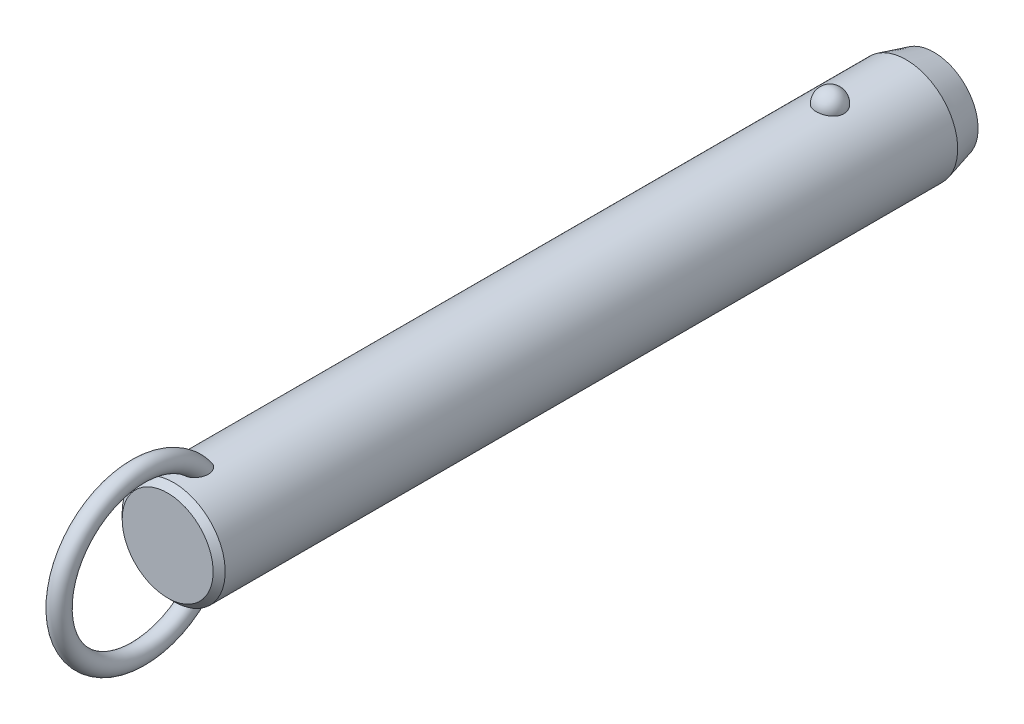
ISO-10303-21;
HEADER;
FILE_DESCRIPTION(('STEP AP214'),'2;1');
FILE_NAME('part.step','',(''),(''),'','','');
FILE_SCHEMA(('AUTOMOTIVE_DESIGN { 1 0 10303 214 1 1 1 1 }'));
ENDSEC;
DATA;
#1=APPLICATION_CONTEXT('core data for automotive mechanical design processes');
#2=APPLICATION_PROTOCOL_DEFINITION('international standard','automotive_design',2000,#1);
#3=PRODUCT_CONTEXT('',#1,'mechanical');
#4=PRODUCT('Part','Part','',(#3));
#5=PRODUCT_RELATED_PRODUCT_CATEGORY('part','',(#4));
#6=PRODUCT_DEFINITION_FORMATION('','',#4);
#7=PRODUCT_DEFINITION_CONTEXT('part definition',#1,'design');
#8=PRODUCT_DEFINITION('design','',#6,#7);
#9=PRODUCT_DEFINITION_SHAPE('','',#8);
#10=(LENGTH_UNIT() NAMED_UNIT(*) SI_UNIT(.MILLI.,.METRE.));
#11=(NAMED_UNIT(*) PLANE_ANGLE_UNIT() SI_UNIT($,.RADIAN.));
#12=(NAMED_UNIT(*) SI_UNIT($,.STERADIAN.) SOLID_ANGLE_UNIT());
#13=UNCERTAINTY_MEASURE_WITH_UNIT(LENGTH_MEASURE(1.E-05),#10,'distance_accuracy_value','');
#14=(GEOMETRIC_REPRESENTATION_CONTEXT(3) GLOBAL_UNCERTAINTY_ASSIGNED_CONTEXT((#13)) GLOBAL_UNIT_ASSIGNED_CONTEXT((#10,
#11,#12)) REPRESENTATION_CONTEXT('',''));
#15=CARTESIAN_POINT('',(0.,0.,0.));
#16=DIRECTION('',(0.,0.,1.));
#17=DIRECTION('',(1.,0.,0.));
#18=AXIS2_PLACEMENT_3D('',#15,#16,#17);
#19=CARTESIAN_POINT('',(0.,0.,127.));
#20=DIRECTION('',(0.,0.,-1.));
#21=DIRECTION('',(-1.,0.,0.));
#22=AXIS2_PLACEMENT_3D('',#19,#20,#21);
#23=CYLINDRICAL_SURFACE('',#22,11.1);
#24=CARTESIAN_POINT('',(2.9724815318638,10.6945945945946,-3.));
#25=CARTESIAN_POINT('',(2.97247830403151,10.6945972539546,-2.83225059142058));
#26=CARTESIAN_POINT('',(2.95876598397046,10.6984356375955,-2.66445972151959));
#27=CARTESIAN_POINT('',(2.90424529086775,10.7133624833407,-2.33362381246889));
#28=CARTESIAN_POINT('',(2.8634252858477,10.7244540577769,-2.1705808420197));
#29=CARTESIAN_POINT('',(2.75573657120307,10.7526272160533,-1.85396767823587));
#30=CARTESIAN_POINT('',(2.68887937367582,10.7697061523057,-1.70039333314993));
#31=CARTESIAN_POINT('',(2.53079696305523,10.8079438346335,-1.40691598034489));
#32=CARTESIAN_POINT('',(2.43957264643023,10.8291024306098,-1.2670124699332));
#33=CARTESIAN_POINT('',(2.23458150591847,10.8732541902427,-1.00409565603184));
#34=CARTESIAN_POINT('',(2.12071295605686,10.8962553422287,-0.881162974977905));
#35=CARTESIAN_POINT('',(1.87365402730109,10.9414421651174,-0.656352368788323));
#36=CARTESIAN_POINT('',(1.74046358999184,10.9636278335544,-0.554474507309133));
#37=CARTESIAN_POINT('',(1.45872188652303,11.0046495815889,-0.374872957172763));
#38=CARTESIAN_POINT('',(1.31021276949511,11.0234944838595,-0.297085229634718));
#39=CARTESIAN_POINT('',(1.00170030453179,11.0557957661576,-0.167529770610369));
#40=CARTESIAN_POINT('',(0.841698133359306,11.0692526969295,-0.115759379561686));
#41=CARTESIAN_POINT('',(0.517607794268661,11.0890932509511,-0.0403925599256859));
#42=CARTESIAN_POINT('',(0.353633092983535,11.0955916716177,-0.0163383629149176));
#43=CARTESIAN_POINT('',(0.0238420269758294,11.1011989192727,0.0044517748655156));
#44=CARTESIAN_POINT('',(-0.141974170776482,11.1003084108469,0.00119017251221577));
#45=CARTESIAN_POINT('',(-0.468405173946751,11.0912990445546,-0.0323233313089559));
#46=CARTESIAN_POINT('',(-0.629059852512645,11.0832767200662,-0.0622147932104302));
#47=CARTESIAN_POINT('',(-0.942937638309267,11.0609962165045,-0.147645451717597));
#48=CARTESIAN_POINT('',(-1.09616062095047,11.0467379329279,-0.203185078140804));
#49=CARTESIAN_POINT('',(-1.39181061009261,11.0134071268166,-0.3387529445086));
#50=CARTESIAN_POINT('',(-1.53417383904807,10.9943086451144,-0.418913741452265));
#51=CARTESIAN_POINT('',(-1.80342160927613,10.9533667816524,-0.60144882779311));
#52=CARTESIAN_POINT('',(-1.9303046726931,10.9315231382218,-0.703825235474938));
#53=CARTESIAN_POINT('',(-2.16747598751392,10.887005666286,-0.930091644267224));
#54=CARTESIAN_POINT('',(-2.27742774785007,10.8643239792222,-1.05433291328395));
#55=CARTESIAN_POINT('',(-2.47517316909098,10.8209886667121,-1.31966633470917));
#56=CARTESIAN_POINT('',(-2.56296538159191,10.8003351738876,-1.46075958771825));
#57=CARTESIAN_POINT('',(-2.71500300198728,10.7631304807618,-1.75753646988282));
#58=CARTESIAN_POINT('',(-2.77898901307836,10.7466250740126,-1.91335887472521));
#59=CARTESIAN_POINT('',(-2.88046189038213,10.7198747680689,-2.2339152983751));
#60=CARTESIAN_POINT('',(-2.91794947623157,10.709629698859,-2.39864907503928));
#61=CARTESIAN_POINT('',(-2.96537819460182,10.6965949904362,-2.73165170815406));
#62=CARTESIAN_POINT('',(-2.97542891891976,10.693775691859,-2.89990378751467));
#63=CARTESIAN_POINT('',(-2.96804271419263,10.6958279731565,-3.235752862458));
#64=CARTESIAN_POINT('',(-2.95060646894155,10.7006993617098,-3.40334987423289));
#65=CARTESIAN_POINT('',(-2.88883358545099,10.71753912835,-3.73233906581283));
#66=CARTESIAN_POINT('',(-2.84462026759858,10.7294749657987,-3.89375610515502));
#67=CARTESIAN_POINT('',(-2.73050447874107,10.7590797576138,-4.20667949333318));
#68=CARTESIAN_POINT('',(-2.66060103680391,10.7767489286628,-4.35818546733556));
#69=CARTESIAN_POINT('',(-2.49642559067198,10.8159599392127,-4.6478542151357));
#70=CARTESIAN_POINT('',(-2.40203047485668,10.8375211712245,-4.78594458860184));
#71=CARTESIAN_POINT('',(-2.19143488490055,10.8820570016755,-5.0441038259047));
#72=CARTESIAN_POINT('',(-2.07523364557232,10.9050316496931,-5.16417205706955));
#73=CARTESIAN_POINT('',(-1.82361254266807,10.9499219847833,-5.38334833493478));
#74=CARTESIAN_POINT('',(-1.68812945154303,10.9718338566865,-5.48238464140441));
#75=CARTESIAN_POINT('',(-1.40191298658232,11.0120611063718,-5.65618873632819));
#76=CARTESIAN_POINT('',(-1.25118062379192,11.0303767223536,-5.73095813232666));
#77=CARTESIAN_POINT('',(-0.940570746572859,11.0611653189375,-5.85334725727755));
#78=CARTESIAN_POINT('',(-0.780821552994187,11.0737044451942,-5.90127578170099));
#79=CARTESIAN_POINT('',(-0.455204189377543,11.0918598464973,-5.96992976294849));
#80=CARTESIAN_POINT('',(-0.289336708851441,11.0974768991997,-5.99065827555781));
#81=CARTESIAN_POINT('',(0.0406846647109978,11.1011307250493,-6.00418773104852));
#82=CARTESIAN_POINT('',(0.204817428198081,11.099299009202,-5.99747318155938));
#83=CARTESIAN_POINT('',(0.5295530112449,11.088551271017,-5.9574031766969));
#84=CARTESIAN_POINT('',(0.69015594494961,11.0796354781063,-5.92404858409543));
#85=CARTESIAN_POINT('',(1.0027760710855,11.0557204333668,-5.83180084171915));
#86=CARTESIAN_POINT('',(1.15482001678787,11.0407414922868,-5.77299291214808));
#87=CARTESIAN_POINT('',(1.44678373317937,11.0062913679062,-5.63147366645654));
#88=CARTESIAN_POINT('',(1.58670279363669,10.9868199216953,-5.54876095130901));
#89=CARTESIAN_POINT('',(1.8527023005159,10.9451315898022,-5.36027644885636));
#90=CARTESIAN_POINT('',(1.97855158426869,10.9228788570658,-5.25418644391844));
#91=CARTESIAN_POINT('',(2.21080872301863,10.8782509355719,-5.02251354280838));
#92=CARTESIAN_POINT('',(2.31721312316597,10.8558757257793,-4.89692718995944));
#93=CARTESIAN_POINT('',(2.5094551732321,10.8130715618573,-4.62745408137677));
#94=CARTESIAN_POINT('',(2.59493284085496,10.7926798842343,-4.48330448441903));
#95=CARTESIAN_POINT('',(2.740862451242,10.7565495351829,-4.18236358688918));
#96=CARTESIAN_POINT('',(2.80132490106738,10.7408089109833,-4.02557762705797));
#97=CARTESIAN_POINT('',(2.88959070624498,10.7173718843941,-3.72475308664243));
#98=CARTESIAN_POINT('',(2.92062102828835,10.7088950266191,-3.58171216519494));
#99=CARTESIAN_POINT('',(2.96206765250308,10.6975052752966,-3.29245795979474));
#100=CARTESIAN_POINT('',(2.97248434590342,10.6945922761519,-3.14624473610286));
#101=CARTESIAN_POINT('',(2.9724815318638,10.6945945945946,-3.));
#102=B_SPLINE_CURVE_WITH_KNOTS('',3,(#24,#25,#26,#27,#28,#29,#30,#31,#32,#33,#34,#35,#36,#37,
#38,#39,#40,#41,#42,#43,#44,#45,#46,#47,#48,#49,#50,#51,#52,#53,#54,#55,#56,#57,#58,#59,#60,#61,
#62,#63,#64,#65,#66,#67,#68,#69,#70,#71,#72,#73,#74,#75,#76,#77,#78,#79,#80,#81,#82,#83,#84,#85,
#86,#87,#88,#89,#90,#91,#92,#93,#94,#95,#96,#97,#98,#99,#100,#101),.UNSPECIFIED.,.T.,.F.,(4,2,2,
2,2,2,2,2,2,2,2,2,2,2,2,2,2,2,2,2,2,2,2,2,2,2,2,2,2,2,2,2,2,2,2,2,2,2,4),(0.,0.502722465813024,
1.00566079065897,1.5083769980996,2.01107471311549,2.51608392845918,3.02109467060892,
3.52475118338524,4.02835620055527,4.523518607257,5.0186364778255,5.50715297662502,
5.9956776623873,6.48688002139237,6.97812923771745,7.47814366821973,7.9781907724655,
8.48353712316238,8.9888697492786,9.49218093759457,9.99547960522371,10.4964777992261,
10.997494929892,11.5010810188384,12.0046847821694,12.5099796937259,13.0152411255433,
13.5145635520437,14.0138298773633,14.5043200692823,14.9947943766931,15.4836390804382,
15.9725123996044,16.4685040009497,16.9645836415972,17.4686765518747,17.972557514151,
18.410841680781,18.849117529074),.UNSPECIFIED.);
#103=CARTESIAN_POINT('',(2.9724815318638,10.6945945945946,-3.));
#104=VERTEX_POINT('',#103);
#105=EDGE_CURVE('E41',#104,#104,#102,.T.);
#106=ORIENTED_EDGE('',*,*,#105,.T.);
#107=EDGE_LOOP('',(#106));
#108=FACE_BOUND('',#107,.T.);
#109=CARTESIAN_POINT('',(0.,0.,138.4));
#110=DIRECTION('',(0.,0.,1.));
#111=DIRECTION('',(1.,0.,0.));
#112=AXIS2_PLACEMENT_3D('',#109,#110,#111);
#113=CIRCLE('',#112,11.1);
#114=CARTESIAN_POINT('',(-11.1,0.,138.4));
#115=VERTEX_POINT('',#114);
#116=EDGE_CURVE('E10',#115,#115,#113,.F.);
#117=ORIENTED_EDGE('',*,*,#116,.T.);
#118=EDGE_LOOP('',(#117));
#119=FACE_BOUND('',#118,.T.);
#120=CARTESIAN_POINT('',(-0.564520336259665,-11.0856356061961,130.657815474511));
#121=CARTESIAN_POINT('',(-0.667202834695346,-11.0804062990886,130.691283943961));
#122=CARTESIAN_POINT('',(-0.766875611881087,-11.0738877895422,130.733835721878));
#123=CARTESIAN_POINT('',(-0.95728412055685,-11.0590576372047,130.835419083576));
#124=CARTESIAN_POINT('',(-1.04801616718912,-11.0507452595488,130.89445742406));
#125=CARTESIAN_POINT('',(-1.21800952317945,-11.0333016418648,131.026529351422));
#126=CARTESIAN_POINT('',(-1.2973080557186,-11.0241732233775,131.099515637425));
#127=CARTESIAN_POINT('',(-1.44337665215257,-11.0060026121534,131.257037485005));
#128=CARTESIAN_POINT('',(-1.51014622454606,-10.9969604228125,131.341573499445));
#129=CARTESIAN_POINT('',(-1.63454620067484,-10.9791841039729,131.525521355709));
#130=CARTESIAN_POINT('',(-1.69127003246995,-10.9705107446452,131.625549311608));
#131=CARTESIAN_POINT('',(-1.7898078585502,-10.9548648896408,131.832790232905));
#132=CARTESIAN_POINT('',(-1.83161214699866,-10.9478935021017,131.940007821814));
#133=CARTESIAN_POINT('',(-1.91557028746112,-10.9335803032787,132.205408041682));
#134=CARTESIAN_POINT('',(-1.95040620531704,-10.9273269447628,132.365980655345));
#135=CARTESIAN_POINT('',(-1.99388326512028,-10.9194709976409,132.690697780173));
#136=CARTESIAN_POINT('',(-2.00248051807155,-10.9178762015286,132.854847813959));
#137=CARTESIAN_POINT('',(-1.99551615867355,-10.9191578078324,133.224650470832));
#138=CARTESIAN_POINT('',(-1.9732206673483,-10.9232807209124,133.430191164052));
#139=CARTESIAN_POINT('',(-1.9152976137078,-10.9335244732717,133.733595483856));
#140=CARTESIAN_POINT('',(-1.89184575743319,-10.9376266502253,133.834088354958));
#141=CARTESIAN_POINT('',(-1.83700674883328,-10.9469720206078,134.032855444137));
#142=CARTESIAN_POINT('',(-1.80562070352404,-10.9522150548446,134.131129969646));
#143=CARTESIAN_POINT('',(-1.73463055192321,-10.9636837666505,134.325914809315));
#144=CARTESIAN_POINT('',(-1.69493416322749,-10.9699202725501,134.422390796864));
#145=CARTESIAN_POINT('',(-1.60745141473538,-10.9830806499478,134.611626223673));
#146=CARTESIAN_POINT('',(-1.55966150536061,-10.9900048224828,134.704384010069));
#147=CARTESIAN_POINT('',(-1.45591812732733,-11.0042280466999,134.884690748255));
#148=CARTESIAN_POINT('',(-1.40000013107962,-11.0115253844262,134.972260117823));
#149=CARTESIAN_POINT('',(-1.27937470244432,-11.0261911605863,135.141029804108));
#150=CARTESIAN_POINT('',(-1.21467835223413,-11.0335594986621,135.22223795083));
#151=CARTESIAN_POINT('',(-1.08218150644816,-11.0473027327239,135.369001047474));
#152=CARTESIAN_POINT('',(-1.01522633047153,-11.0537063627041,135.435309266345));
#153=CARTESIAN_POINT('',(-0.872952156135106,-11.065850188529,135.558378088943));
#154=CARTESIAN_POINT('',(-0.797642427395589,-11.0715911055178,135.615149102));
#155=CARTESIAN_POINT('',(-0.651396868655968,-11.081071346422,135.707515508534));
#156=CARTESIAN_POINT('',(-0.581712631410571,-11.0849841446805,135.745049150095));
#157=CARTESIAN_POINT('',(-0.43706608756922,-11.0916271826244,135.808259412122));
#158=CARTESIAN_POINT('',(-0.362109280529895,-11.0943586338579,135.833948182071));
#159=CARTESIAN_POINT('',(-0.207828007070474,-11.0983242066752,135.871117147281));
#160=CARTESIAN_POINT('',(-0.12846771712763,-11.0995432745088,135.882454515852));
#161=CARTESIAN_POINT('',(0.0309101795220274,-11.1002423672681,135.888965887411));
#162=CARTESIAN_POINT('',(0.110927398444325,-11.0997233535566,135.884148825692));
#163=CARTESIAN_POINT('',(0.25640659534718,-11.097240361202,135.860959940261));
#164=CARTESIAN_POINT('',(0.322235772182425,-11.0955074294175,135.844754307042));
#165=CARTESIAN_POINT('',(0.450635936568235,-11.0910350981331,135.802600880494));
#166=CARTESIAN_POINT('',(0.513205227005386,-11.0882951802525,135.776648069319));
#167=CARTESIAN_POINT('',(0.662626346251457,-11.0805620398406,135.702607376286));
#168=CARTESIAN_POINT('',(0.747127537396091,-11.0751144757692,135.649845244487));
#169=CARTESIAN_POINT('',(0.906756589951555,-11.0631932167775,135.531720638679));
#170=CARTESIAN_POINT('',(0.981859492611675,-11.0567168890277,135.466325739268));
#171=CARTESIAN_POINT('',(1.10712207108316,-11.0447856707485,135.34226337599));
#172=CARTESIAN_POINT('',(1.15909566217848,-11.0394280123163,135.285383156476));
#173=CARTESIAN_POINT('',(1.25791923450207,-11.0286040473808,135.167327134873));
#174=CARTESIAN_POINT('',(1.30476642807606,-11.0231376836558,135.106149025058));
#175=CARTESIAN_POINT('',(1.43818612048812,-11.0068027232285,134.917305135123));
#176=CARTESIAN_POINT('',(1.51751767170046,-10.9960104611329,134.784453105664));
#177=CARTESIAN_POINT('',(1.63597546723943,-10.9788847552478,134.553137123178));
#178=CARTESIAN_POINT('',(1.67988876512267,-10.9722190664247,134.457053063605));
#179=CARTESIAN_POINT('',(1.75953241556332,-10.9597298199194,134.261431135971));
#180=CARTESIAN_POINT('',(1.7952596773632,-10.9539065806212,134.161891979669));
#181=CARTESIAN_POINT('',(1.85844731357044,-10.9433632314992,133.96021118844));
#182=CARTESIAN_POINT('',(1.88591073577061,-10.9386427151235,133.85807052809));
#183=CARTESIAN_POINT('',(1.93234324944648,-10.9305350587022,133.651819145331));
#184=CARTESIAN_POINT('',(1.95131065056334,-10.9271481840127,133.547708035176));
#185=CARTESIAN_POINT('',(1.9904020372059,-10.9201183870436,133.265458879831));
#186=CARTESIAN_POINT('',(2.00221217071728,-10.9179256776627,133.086037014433));
#187=CARTESIAN_POINT('',(1.99711676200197,-10.9188636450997,132.727713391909));
#188=CARTESIAN_POINT('',(1.98026150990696,-10.9219849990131,132.548811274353));
#189=CARTESIAN_POINT('',(1.92151657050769,-10.9324473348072,132.23645144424));
#190=CARTESIAN_POINT('',(1.88605081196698,-10.9386915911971,132.101759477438));
#191=CARTESIAN_POINT('',(1.79393020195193,-10.9541780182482,131.839966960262));
#192=CARTESIAN_POINT('',(1.73729868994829,-10.9634168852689,131.712858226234));
#193=CARTESIAN_POINT('',(1.61237037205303,-10.9824218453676,131.489418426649));
#194=CARTESIAN_POINT('',(1.54715374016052,-10.9918945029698,131.391345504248));
#195=CARTESIAN_POINT('',(1.40127026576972,-11.0114415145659,131.207434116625));
#196=CARTESIAN_POINT('',(1.32060742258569,-11.0215157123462,131.121592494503));
#197=CARTESIAN_POINT('',(1.1447478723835,-11.041168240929,130.965163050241));
#198=CARTESIAN_POINT('',(1.04947805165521,-11.0507437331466,130.894656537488));
#199=CARTESIAN_POINT('',(0.847278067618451,-11.0680789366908,130.772640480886));
#200=CARTESIAN_POINT('',(0.74035174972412,-11.0758392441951,130.721124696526));
#201=CARTESIAN_POINT('',(0.529289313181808,-11.0878275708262,130.643485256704));
#202=CARTESIAN_POINT('',(0.425895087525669,-11.0923259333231,130.615377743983));
#203=CARTESIAN_POINT('',(0.215723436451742,-11.0984001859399,130.577703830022));
#204=CARTESIAN_POINT('',(0.108947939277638,-11.0999777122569,130.568127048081));
#205=CARTESIAN_POINT('',(-0.0938962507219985,-11.1000196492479,130.567877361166));
#206=CARTESIAN_POINT('',(-0.189967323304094,-11.0987797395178,130.575408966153));
#207=CARTESIAN_POINT('',(-0.379657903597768,-11.0939111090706,130.605507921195));
#208=CARTESIAN_POINT('',(-0.47327735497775,-11.0902823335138,130.628075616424));
#209=CARTESIAN_POINT('',(-0.564520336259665,-11.0856356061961,130.657815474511));
#210=B_SPLINE_CURVE_WITH_KNOTS('',3,(#120,#121,#122,#123,#124,#125,#126,#127,#128,#129,#130,
#131,#132,#133,#134,#135,#136,#137,#138,#139,#140,#141,#142,#143,#144,#145,#146,#147,#148,#149,
#150,#151,#152,#153,#154,#155,#156,#157,#158,#159,#160,#161,#162,#163,#164,#165,#166,#167,#168,
#169,#170,#171,#172,#173,#174,#175,#176,#177,#178,#179,#180,#181,#182,#183,#184,#185,#186,#187,
#188,#189,#190,#191,#192,#193,#194,#195,#196,#197,#198,#199,#200,#201,#202,#203,#204,#205,#206,
#207,#208,#209),.UNSPECIFIED.,.T.,.F.,(4,2,2,2,2,2,2,2,2,2,2,2,2,2,2,2,2,2,2,2,2,2,2,2,2,2,2,2,
2,2,2,2,2,2,2,2,2,2,2,2,2,2,2,2,4),(0.,0.323999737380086,0.64813245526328,0.971184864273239,
1.29424994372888,1.63886237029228,1.98369857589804,2.47426059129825,2.96564271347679,
3.58257396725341,3.89215258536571,4.20168803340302,4.51486273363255,4.82817514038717,
5.14015911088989,5.45175282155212,5.73442856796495,6.01679375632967,6.2536458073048,
6.49025437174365,6.72919963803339,6.96801276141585,7.17061258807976,7.37331685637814,
7.67094989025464,7.96935728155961,8.20075067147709,8.4322692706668,8.89581623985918,
9.21306533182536,9.53043400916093,9.84768549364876,10.1650000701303,10.7022930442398,
11.2386443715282,11.655339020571,12.071575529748,12.4245637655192,12.7774607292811,
13.1321855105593,13.4867936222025,13.8068771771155,14.1267813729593,14.4146787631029,
14.7025827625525),.UNSPECIFIED.);
#211=CARTESIAN_POINT('',(-0.564520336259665,-11.0856356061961,130.657815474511));
#212=VERTEX_POINT('',#211);
#213=EDGE_CURVE('E60',#212,#212,#210,.T.);
#214=ORIENTED_EDGE('',*,*,#213,.T.);
#215=EDGE_LOOP('',(#214));
#216=FACE_BOUND('',#215,.T.);
#217=CARTESIAN_POINT('',(-0.564520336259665,11.0856356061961,130.657815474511));
#218=CARTESIAN_POINT('',(-0.468542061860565,11.0905203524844,130.626545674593));
#219=CARTESIAN_POINT('',(-0.369793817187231,11.0942886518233,130.603157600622));
#220=CARTESIAN_POINT('',(-0.169555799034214,11.0991586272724,130.573085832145));
#221=CARTESIAN_POINT('',(-0.0680604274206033,11.1002543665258,130.56643932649));
#222=CARTESIAN_POINT('',(0.134549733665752,11.099646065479,130.570157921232));
#223=CARTESIAN_POINT('',(0.235664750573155,11.0979441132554,130.58051033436));
#224=CARTESIAN_POINT('',(0.434632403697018,11.0919342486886,130.617831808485));
#225=CARTESIAN_POINT('',(0.532486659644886,11.0876276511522,130.644792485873));
#226=CARTESIAN_POINT('',(0.722445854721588,11.0768742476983,130.7144096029));
#227=CARTESIAN_POINT('',(0.814543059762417,11.0704246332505,130.757086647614));
#228=CARTESIAN_POINT('',(0.990565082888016,11.0560659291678,130.856648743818));
#229=CARTESIAN_POINT('',(1.07448844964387,11.048156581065,130.913536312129));
#230=CARTESIAN_POINT('',(1.23562672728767,11.0313221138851,131.042210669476));
#231=CARTESIAN_POINT('',(1.3124268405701,11.0223686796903,131.114511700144));
#232=CARTESIAN_POINT('',(1.45398030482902,11.0045918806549,131.270042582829));
#233=CARTESIAN_POINT('',(1.51873073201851,10.9957685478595,131.353275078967));
#234=CARTESIAN_POINT('',(1.64107232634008,10.9782087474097,131.536384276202));
#235=CARTESIAN_POINT('',(1.6974317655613,10.9695572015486,131.637089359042));
#236=CARTESIAN_POINT('',(1.79515063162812,10.9539887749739,131.845626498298));
#237=CARTESIAN_POINT('',(1.83649966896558,10.9470730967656,131.95346343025));
#238=CARTESIAN_POINT('',(1.91931148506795,10.9329211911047,132.220399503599));
#239=CARTESIAN_POINT('',(1.95340104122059,10.9267904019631,132.381861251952));
#240=CARTESIAN_POINT('',(1.99526195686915,10.9192174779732,132.70821631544));
#241=CARTESIAN_POINT('',(2.00298989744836,10.9177830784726,132.87311484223));
#242=CARTESIAN_POINT('',(1.99396251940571,10.9194420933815,133.244100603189));
#243=CARTESIAN_POINT('',(1.97050829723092,10.923774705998,133.45003871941));
#244=CARTESIAN_POINT('',(1.91079643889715,10.9343131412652,133.753901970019));
#245=CARTESIAN_POINT('',(1.88673702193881,10.9385106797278,133.854529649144));
#246=CARTESIAN_POINT('',(1.8306550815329,10.9480376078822,134.053510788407));
#247=CARTESIAN_POINT('',(1.79863369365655,10.9533668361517,134.151864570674));
#248=CARTESIAN_POINT('',(1.72633365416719,10.9649954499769,134.346720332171));
#249=CARTESIAN_POINT('',(1.68596409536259,10.9713053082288,134.44318790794));
#250=CARTESIAN_POINT('',(1.59707998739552,10.9845964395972,134.632323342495));
#251=CARTESIAN_POINT('',(1.54856169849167,10.9915780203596,134.724989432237));
#252=CARTESIAN_POINT('',(1.44330168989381,11.0058935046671,134.904975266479));
#253=CARTESIAN_POINT('',(1.3865974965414,11.0132257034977,134.992316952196));
#254=CARTESIAN_POINT('',(1.26431158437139,11.0279330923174,135.160456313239));
#255=CARTESIAN_POINT('',(1.19874160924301,11.0353082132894,135.241262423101));
#256=CARTESIAN_POINT('',(1.06542088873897,11.048931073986,135.385985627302));
#257=CARTESIAN_POINT('',(0.998640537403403,11.0552153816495,135.450784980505));
#258=CARTESIAN_POINT('',(0.856896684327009,11.0671032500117,135.570846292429));
#259=CARTESIAN_POINT('',(0.781942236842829,11.0727075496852,135.626118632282));
#260=CARTESIAN_POINT('',(0.636276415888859,11.081949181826,135.715972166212));
#261=CARTESIAN_POINT('',(0.566755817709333,11.0857572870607,135.752441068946));
#262=CARTESIAN_POINT('',(0.422602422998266,11.0921860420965,135.813533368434));
#263=CARTESIAN_POINT('',(0.347974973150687,11.0948079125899,135.838168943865));
#264=CARTESIAN_POINT('',(0.194593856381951,11.0985608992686,135.873323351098));
#265=CARTESIAN_POINT('',(0.115807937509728,11.0996777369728,135.883706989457));
#266=CARTESIAN_POINT('',(-0.0422499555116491,11.1002003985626,135.888574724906));
#267=CARTESIAN_POINT('',(-0.121521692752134,11.09960699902,135.883066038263));
#268=CARTESIAN_POINT('',(-0.266046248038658,11.0970123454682,135.858827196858));
#269=CARTESIAN_POINT('',(-0.331661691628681,11.0952283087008,135.842135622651));
#270=CARTESIAN_POINT('',(-0.459588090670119,11.0906663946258,135.799111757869));
#271=CARTESIAN_POINT('',(-0.52189737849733,11.0878880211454,135.772774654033));
#272=CARTESIAN_POINT('',(-0.671446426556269,11.0800342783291,135.697513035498));
#273=CARTESIAN_POINT('',(-0.756250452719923,11.0744969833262,135.643818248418));
#274=CARTESIAN_POINT('',(-0.916349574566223,11.0624045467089,135.523802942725));
#275=CARTESIAN_POINT('',(-0.991618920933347,11.0558467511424,135.457449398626));
#276=CARTESIAN_POINT('',(-1.11713140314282,11.0437783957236,135.331633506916));
#277=CARTESIAN_POINT('',(-1.1692053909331,11.0383619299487,135.273952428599));
#278=CARTESIAN_POINT('',(-1.26817476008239,11.02743010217,135.154280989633));
#279=CARTESIAN_POINT('',(-1.31506731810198,11.0219146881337,135.092288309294));
#280=CARTESIAN_POINT('',(-1.40399813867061,11.0109399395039,134.964784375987));
#281=CARTESIAN_POINT('',(-1.44602864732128,11.0054807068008,134.899267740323));
#282=CARTESIAN_POINT('',(-1.52538779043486,10.9947621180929,134.765422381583));
#283=CARTESIAN_POINT('',(-1.56271516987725,10.9895028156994,134.697092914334));
#284=CARTESIAN_POINT('',(-1.64537943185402,10.9774790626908,134.533210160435));
#285=CARTESIAN_POINT('',(-1.68879497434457,10.9708503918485,134.4366735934));
#286=CARTESIAN_POINT('',(-1.76740738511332,10.9584602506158,134.240236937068));
#287=CARTESIAN_POINT('',(-1.80260120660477,10.95269910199,134.14033561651));
#288=CARTESIAN_POINT('',(-1.86468657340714,10.9423003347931,133.937966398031));
#289=CARTESIAN_POINT('',(-1.8915816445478,10.9376622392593,133.835499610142));
#290=CARTESIAN_POINT('',(-1.93682458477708,10.9297405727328,133.628642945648));
#291=CARTESIAN_POINT('',(-1.95517082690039,10.9264572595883,133.524252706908));
#292=CARTESIAN_POINT('',(-1.99232562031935,10.9197647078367,133.24262876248));
#293=CARTESIAN_POINT('',(-2.00294603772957,10.9177914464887,133.064185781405));
#294=CARTESIAN_POINT('',(-1.99566675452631,10.9191290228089,132.707996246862));
#295=CARTESIAN_POINT('',(-1.97781651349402,10.9224306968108,132.53024902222));
#296=CARTESIAN_POINT('',(-1.91747214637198,10.9331592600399,132.219792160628));
#297=CARTESIAN_POINT('',(-1.88131022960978,10.9395108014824,132.085825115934));
#298=CARTESIAN_POINT('',(-1.78790380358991,10.9551659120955,131.82559757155));
#299=CARTESIAN_POINT('',(-1.73068309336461,10.9644661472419,131.699328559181));
#300=CARTESIAN_POINT('',(-1.60475573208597,10.9835398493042,131.47741565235));
#301=CARTESIAN_POINT('',(-1.53908879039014,10.9930297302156,131.380026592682));
#302=CARTESIAN_POINT('',(-1.39238608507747,11.0125708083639,131.197525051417));
#303=CARTESIAN_POINT('',(-1.31135150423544,11.0226219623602,131.112411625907));
#304=CARTESIAN_POINT('',(-1.14382035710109,11.0411991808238,130.96529943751));
#305=CARTESIAN_POINT('',(-1.0585850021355,11.0497792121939,130.90186930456));
#306=CARTESIAN_POINT('',(-0.878723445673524,11.0655285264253,130.790250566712));
#307=CARTESIAN_POINT('',(-0.784123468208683,11.0727015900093,130.742020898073));
#308=CARTESIAN_POINT('',(-0.646163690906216,11.0812501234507,130.686023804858));
#309=CARTESIAN_POINT('',(-0.605595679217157,11.0835451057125,130.671197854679));
#310=CARTESIAN_POINT('',(-0.564520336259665,11.0856356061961,130.657815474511));
#311=B_SPLINE_CURVE_WITH_KNOTS('',3,(#217,#218,#219,#220,#221,#222,#223,#224,#225,#226,#227,
#228,#229,#230,#231,#232,#233,#234,#235,#236,#237,#238,#239,#240,#241,#242,#243,#244,#245,#246,
#247,#248,#249,#250,#251,#252,#253,#254,#255,#256,#257,#258,#259,#260,#261,#262,#263,#264,#265,
#266,#267,#268,#269,#270,#271,#272,#273,#274,#275,#276,#277,#278,#279,#280,#281,#282,#283,#284,
#285,#286,#287,#288,#289,#290,#291,#292,#293,#294,#295,#296,#297,#298,#299,#300,#301,#302,#303,
#304,#305,#306,#307,#308,#309,#310),.UNSPECIFIED.,.T.,.F.,(4,2,2,2,2,2,2,2,2,2,2,2,2,2,2,2,2,2,
2,2,2,2,2,2,2,2,2,2,2,2,2,2,2,2,2,2,2,2,2,2,2,2,2,2,2,2,4),(0.,0.303061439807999,
0.606795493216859,0.910302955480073,1.21365733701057,1.51741085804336,1.82121821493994,
2.13745205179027,2.45376252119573,2.79958678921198,3.14564996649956,3.63832391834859,
4.13180893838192,4.75031912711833,5.06071926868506,5.37107516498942,5.6850077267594,
5.99908475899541,6.31176519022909,6.62403542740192,6.90315673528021,7.18197194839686,
7.41687778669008,7.65154134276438,7.88841587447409,8.12518286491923,8.32752842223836,
8.52997509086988,8.82986421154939,9.13054668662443,9.36393502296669,9.5974499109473,
9.83133221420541,10.0652767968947,10.383032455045,10.7009056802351,11.0186436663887,
11.3364420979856,11.8705925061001,12.4038159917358,12.8189662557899,13.2336487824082,
13.5857049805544,13.9377340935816,14.2561354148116,14.5736690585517,14.7033687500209),.UNSPECIFIED.);
#312=CARTESIAN_POINT('',(-0.564520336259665,11.0856356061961,130.657815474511));
#313=VERTEX_POINT('',#312);
#314=EDGE_CURVE('E67',#313,#313,#311,.T.);
#315=ORIENTED_EDGE('',*,*,#314,.T.);
#316=EDGE_LOOP('',(#315));
#317=FACE_BOUND('',#316,.T.);
#318=CARTESIAN_POINT('',(0.,0.,-19.3999999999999));
#319=DIRECTION('',(0.,0.,-1.));
#320=DIRECTION('',(-1.,0.,0.));
#321=AXIS2_PLACEMENT_3D('',#318,#319,#320);
#322=CIRCLE('',#321,11.1);
#323=CARTESIAN_POINT('',(-11.1,0.,-19.3999999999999));
#324=VERTEX_POINT('',#323);
#325=EDGE_CURVE('E57',#324,#324,#322,.F.);
#326=ORIENTED_EDGE('',*,*,#325,.T.);
#327=EDGE_LOOP('',(#326));
#328=FACE_BOUND('',#327,.T.);
#329=ADVANCED_FACE('F37',(#108,#119,#216,#317,#328),#23,.T.);
#330=CARTESIAN_POINT('',(0.,0.,-25.4));
#331=DIRECTION('',(0.,0.,-1.));
#332=DIRECTION('',(-1.,0.,0.));
#333=AXIS2_PLACEMENT_3D('',#330,#331,#332);
#334=PLANE('',#333);
#335=CARTESIAN_POINT('',(0.,0.,-25.4));
#336=DIRECTION('',(0.,0.,-1.));
#337=DIRECTION('',(-1.,0.,0.));
#338=AXIS2_PLACEMENT_3D('',#335,#336,#337);
#339=CIRCLE('',#338,9.49230484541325);
#340=CARTESIAN_POINT('',(-9.49230484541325,0.,-25.4));
#341=VERTEX_POINT('',#340);
#342=EDGE_CURVE('E66',#341,#341,#339,.T.);
#343=ORIENTED_EDGE('',*,*,#342,.T.);
#344=EDGE_LOOP('',(#343));
#345=FACE_BOUND('',#344,.T.);
#346=ADVANCED_FACE('F85',(#345),#334,.T.);
#347=CARTESIAN_POINT('',(0.,0.,-25.4));
#348=DIRECTION('',(0.,0.,1.));
#349=DIRECTION('',(1.,0.,0.));
#350=AXIS2_PLACEMENT_3D('',#347,#348,#349);
#351=CONICAL_SURFACE('',#350,9.49230484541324,0.261799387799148);
#352=ORIENTED_EDGE('',*,*,#325,.F.);
#353=EDGE_LOOP('',(#352));
#354=FACE_BOUND('',#353,.T.);
#355=ORIENTED_EDGE('',*,*,#342,.F.);
#356=EDGE_LOOP('',(#355));
#357=FACE_BOUND('',#356,.T.);
#358=ADVANCED_FACE('F83',(#354,#357),#351,.T.);
#359=CARTESIAN_POINT('',(0.,0.,139.7));
#360=DIRECTION('',(0.,0.,1.));
#361=DIRECTION('',(1.,0.,0.));
#362=AXIS2_PLACEMENT_3D('',#359,#360,#361);
#363=PLANE('',#362);
#364=CARTESIAN_POINT('',(0.,0.,139.7));
#365=DIRECTION('',(0.,0.,1.));
#366=DIRECTION('',(1.,0.,0.));
#367=AXIS2_PLACEMENT_3D('',#364,#365,#366);
#368=CIRCLE('',#367,9.80000000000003);
#369=CARTESIAN_POINT('',(-9.80000000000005,0.,139.7));
#370=VERTEX_POINT('',#369);
#371=EDGE_CURVE('E50',#370,#370,#368,.T.);
#372=ORIENTED_EDGE('',*,*,#371,.T.);
#373=EDGE_LOOP('',(#372));
#374=FACE_BOUND('',#373,.T.);
#375=ADVANCED_FACE('F77',(#374),#363,.T.);
#376=CARTESIAN_POINT('',(0.,0.,146.05));
#377=DIRECTION('',(1.,0.,0.));
#378=DIRECTION('',(0.,0.,-1.));
#379=AXIS2_PLACEMENT_3D('',#376,#377,#378);
#380=TOROIDAL_SURFACE('',#379,17.05,2.);
#381=ORIENTED_EDGE('',*,*,#314,.F.);
#382=EDGE_LOOP('',(#381));
#383=FACE_BOUND('',#382,.T.);
#384=ORIENTED_EDGE('',*,*,#213,.F.);
#385=EDGE_LOOP('',(#384));
#386=FACE_BOUND('',#385,.T.);
#387=ADVANCED_FACE('F73',(#383,#386),#380,.T.);
#388=CARTESIAN_POINT('',(0.,0.,139.7));
#389=DIRECTION('',(0.,0.,-1.));
#390=DIRECTION('',(-1.,0.,0.));
#391=AXIS2_PLACEMENT_3D('',#388,#389,#390);
#392=CONICAL_SURFACE('',#391,9.80000000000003,0.785398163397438);
#393=CARTESIAN_POINT('',(-11.1,0.,138.4));
#394=CARTESIAN_POINT('',(-11.0864583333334,0.,138.413541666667));
#395=CARTESIAN_POINT('',(-11.0729166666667,0.,138.427083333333));
#396=CARTESIAN_POINT('',(-11.0458333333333,0.,138.454166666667));
#397=CARTESIAN_POINT('',(-11.0322916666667,0.,138.467708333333));
#398=CARTESIAN_POINT('',(-11.0052083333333,0.,138.494791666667));
#399=CARTESIAN_POINT('',(-10.9916666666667,0.,138.508333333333));
#400=CARTESIAN_POINT('',(-10.9645833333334,0.,138.535416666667));
#401=CARTESIAN_POINT('',(-10.9510416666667,0.,138.548958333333));
#402=CARTESIAN_POINT('',(-10.9239583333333,0.,138.576041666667));
#403=CARTESIAN_POINT('',(-10.9104166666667,0.,138.589583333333));
#404=CARTESIAN_POINT('',(-10.8833333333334,0.,138.616666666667));
#405=CARTESIAN_POINT('',(-10.8697916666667,0.,138.630208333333));
#406=CARTESIAN_POINT('',(-10.8427083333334,0.,138.657291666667));
#407=CARTESIAN_POINT('',(-10.8291666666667,0.,138.670833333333));
#408=CARTESIAN_POINT('',(-10.8020833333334,0.,138.697916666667));
#409=CARTESIAN_POINT('',(-10.7885416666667,0.,138.711458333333));
#410=CARTESIAN_POINT('',(-10.7614583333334,0.,138.738541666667));
#411=CARTESIAN_POINT('',(-10.7479166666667,0.,138.752083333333));
#412=CARTESIAN_POINT('',(-10.7208333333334,0.,138.779166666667));
#413=CARTESIAN_POINT('',(-10.7072916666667,0.,138.792708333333));
#414=CARTESIAN_POINT('',(-10.6802083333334,0.,138.819791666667));
#415=CARTESIAN_POINT('',(-10.6666666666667,0.,138.833333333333));
#416=CARTESIAN_POINT('',(-10.6395833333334,0.,138.860416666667));
#417=CARTESIAN_POINT('',(-10.6260416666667,0.,138.873958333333));
#418=CARTESIAN_POINT('',(-10.5989583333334,0.,138.901041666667));
#419=CARTESIAN_POINT('',(-10.5854166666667,0.,138.914583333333));
#420=CARTESIAN_POINT('',(-10.5583333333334,0.,138.941666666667));
#421=CARTESIAN_POINT('',(-10.5447916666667,0.,138.955208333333));
#422=CARTESIAN_POINT('',(-10.5177083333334,0.,138.982291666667));
#423=CARTESIAN_POINT('',(-10.5041666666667,0.,138.995833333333));
#424=CARTESIAN_POINT('',(-10.4770833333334,0.,139.022916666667));
#425=CARTESIAN_POINT('',(-10.4635416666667,0.,139.036458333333));
#426=CARTESIAN_POINT('',(-10.4364583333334,0.,139.063541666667));
#427=CARTESIAN_POINT('',(-10.4229166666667,0.,139.077083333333));
#428=CARTESIAN_POINT('',(-10.3958333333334,0.,139.104166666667));
#429=CARTESIAN_POINT('',(-10.3822916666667,0.,139.117708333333));
#430=CARTESIAN_POINT('',(-10.3552083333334,0.,139.144791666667));
#431=CARTESIAN_POINT('',(-10.3416666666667,0.,139.158333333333));
#432=CARTESIAN_POINT('',(-10.3145833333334,0.,139.185416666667));
#433=CARTESIAN_POINT('',(-10.3010416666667,0.,139.198958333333));
#434=CARTESIAN_POINT('',(-10.2739583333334,0.,139.226041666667));
#435=CARTESIAN_POINT('',(-10.2604166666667,0.,139.239583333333));
#436=CARTESIAN_POINT('',(-10.2333333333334,0.,139.266666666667));
#437=CARTESIAN_POINT('',(-10.2197916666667,0.,139.280208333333));
#438=CARTESIAN_POINT('',(-10.1927083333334,0.,139.307291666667));
#439=CARTESIAN_POINT('',(-10.1791666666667,0.,139.320833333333));
#440=CARTESIAN_POINT('',(-10.1520833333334,0.,139.347916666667));
#441=CARTESIAN_POINT('',(-10.1385416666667,0.,139.361458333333));
#442=CARTESIAN_POINT('',(-10.1114583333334,0.,139.388541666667));
#443=CARTESIAN_POINT('',(-10.0979166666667,0.,139.402083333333));
#444=CARTESIAN_POINT('',(-10.0708333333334,0.,139.429166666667));
#445=CARTESIAN_POINT('',(-10.0572916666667,0.,139.442708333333));
#446=CARTESIAN_POINT('',(-10.0302083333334,0.,139.469791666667));
#447=CARTESIAN_POINT('',(-10.0166666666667,0.,139.483333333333));
#448=CARTESIAN_POINT('',(-9.98958333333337,0.,139.510416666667));
#449=CARTESIAN_POINT('',(-9.97604166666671,0.,139.523958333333));
#450=CARTESIAN_POINT('',(-9.94895833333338,0.,139.551041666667));
#451=CARTESIAN_POINT('',(-9.93541666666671,0.,139.564583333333));
#452=CARTESIAN_POINT('',(-9.90833333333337,0.,139.591666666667));
#453=CARTESIAN_POINT('',(-9.89479166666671,0.,139.605208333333));
#454=CARTESIAN_POINT('',(-9.86770833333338,0.,139.632291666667));
#455=CARTESIAN_POINT('',(-9.85416666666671,0.,139.645833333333));
#456=CARTESIAN_POINT('',(-9.82708333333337,0.,139.672916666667));
#457=CARTESIAN_POINT('',(-9.8135416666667,0.,139.686458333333));
#458=CARTESIAN_POINT('',(-9.80000000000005,0.,139.7));
#459=B_SPLINE_CURVE_WITH_KNOTS('',3,(#393,#394,#395,#396,#397,#398,#399,#400,#401,#402,#403,
#404,#405,#406,#407,#408,#409,#410,#411,#412,#413,#414,#415,#416,#417,#418,#419,#420,#421,#422,
#423,#424,#425,#426,#427,#428,#429,#430,#431,#432,#433,#434,#435,#436,#437,#438,#439,#440,#441,
#442,#443,#444,#445,#446,#447,#448,#449,#450,#451,#452,#453,#454,#455,#456,#457,#458),
.UNSPECIFIED.,.F.,.F.,(4,2,2,2,2,2,2,2,2,2,2,2,2,2,2,2,2,2,2,2,2,2,2,2,2,2,2,2,2,2,2,2,4),(0.,
0.0574524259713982,0.114904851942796,0.172357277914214,0.229809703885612,0.28726212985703,
0.344714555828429,0.402166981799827,0.459619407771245,0.517071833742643,0.574524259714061,
0.631976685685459,0.689429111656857,0.746881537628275,0.804333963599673,0.861786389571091,
0.91923881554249,0.976691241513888,1.03414366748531,1.0915960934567,1.14904851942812,
1.20650094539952,1.26395337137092,1.32140579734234,1.37885822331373,1.43631064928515,
1.49376307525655,1.55121550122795,1.60866792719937,1.66612035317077,1.72357277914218,
1.78102520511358,1.838477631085),.UNSPECIFIED.);
#460=EDGE_CURVE('BSEAM39',#115,#370,#459,.T.);
#461=ORIENTED_EDGE('',*,*,#116,.F.);
#462=ORIENTED_EDGE('',*,*,#371,.F.);
#463=ORIENTED_EDGE('',*,*,#460,.T.);
#464=ORIENTED_EDGE('',*,*,#460,.F.);
#465=EDGE_LOOP('',(#461,#463,#462,#464));
#466=FACE_BOUND('',#465,.T.);
#467=ADVANCED_FACE('F39',(#466),#392,.T.);
#468=CARTESIAN_POINT('',(0.,11.1,-3.));
#469=DIRECTION('',(0.,1.,0.));
#470=DIRECTION('',(0.,0.,-1.));
#471=AXIS2_PLACEMENT_3D('',#468,#469,#470);
#472=SPHERICAL_SURFACE('',#471,3.);
#473=ORIENTED_EDGE('',*,*,#105,.F.);
#474=EDGE_LOOP('',(#473));
#475=FACE_BOUND('',#474,.T.);
#476=ADVANCED_FACE('F79',(#475),#472,.T.);
#477=CLOSED_SHELL('',(#329,#346,#358,#375,#387,#467,#476));
#478=MANIFOLD_SOLID_BREP('B2',#477);
#479=ADVANCED_BREP_SHAPE_REPRESENTATION('',(#18,#478),#14);
#480=SHAPE_DEFINITION_REPRESENTATION(#9,#479);
ENDSEC;
END-ISO-10303-21;
